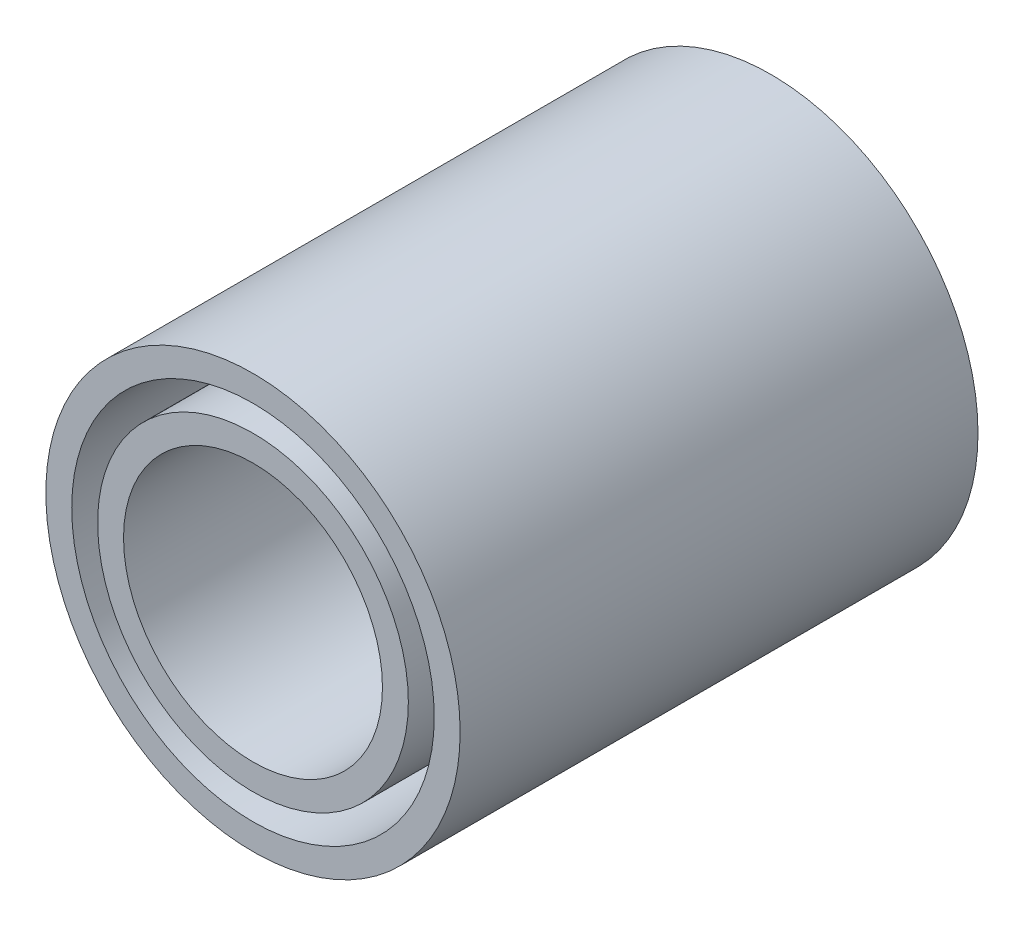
from build123d import *

# Parameters (mm, degrees)
EXTRUDE1_DEPTH        = 50
EXTRUDE1_DEPTH_BACK   = 50
SKETCH1_R             = 30
SKETCH1_R_2           = 25
EXTRUDE1_2_DEPTH      = 50
EXTRUDE1_2_DEPTH_BACK = 50
SKETCH1_R_3           = 40
SKETCH1_R_4           = 35


with BuildPart() as part:
    # Sketch1 → Extrude1 (new, two sides: drawn at the far end of the back side and taken through both)
    with BuildSketch(Plane.XY.offset(-EXTRUDE1_DEPTH_BACK)):
        Circle(SKETCH1_R)
        Circle(SKETCH1_R_2, mode=Mode.SUBTRACT)
    extrude(amount=EXTRUDE1_DEPTH + EXTRUDE1_DEPTH_BACK)


with BuildPart() as body_2:
    # Sketch1 → Extrude1 2 (new, two sides: drawn at the far end of the back side and taken through both)
    with BuildSketch(Plane.XY.offset(-EXTRUDE1_2_DEPTH_BACK)):
        Circle(SKETCH1_R_3)
        Circle(SKETCH1_R_4, mode=Mode.SUBTRACT)
    extrude(amount=EXTRUDE1_2_DEPTH + EXTRUDE1_2_DEPTH_BACK)


solid = Compound([part.part, body_2.part])
